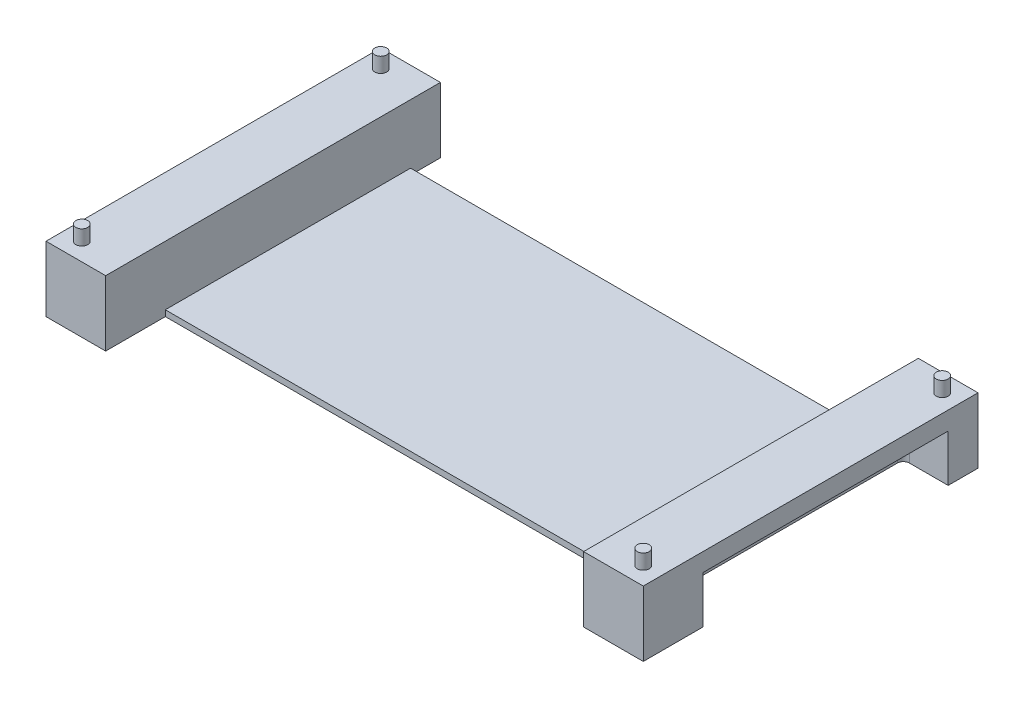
from build123d import *

# Parameters (mm, degrees)
SKETCH1_W             = 10
SKETCH1_H             = 56.1
BOSS_EXTRUDE1_DEPTH   = 3.05
BOSS_EXTRUDE1_2_DEPTH = 3.05
SKETCH1_4_R           = 1
SKETCH1_4_W           = 2.5
SKETCH1_4_H           = 41.1
BOSS_EXTRUDE2_DEPTH   = 7.9
BOSS_EXTRUDE3_START   = -7.9
SKETCH1_5_W           = 80.1
SKETCH1_5_H           = 41.1
BOSS_EXTRUDE3_DEPTH   = 1
BOSS_EXTRUDE4_START   = -7.9
SKETCH1_6_R           = 1
BOSS_EXTRUDE4_DEPTH   = 1
BOSS_EXTRUDE5_START   = 2.5
SKETCH2_R             = 1
BOSS_EXTRUDE5_DEPTH   = 2.5
FILLET1_R             = 1


with BuildPart() as part:
    # Sketch1 → Boss-Extrude1 (new body)
    with BuildSketch(Plane(origin=(0, 0, 0), x_dir=(1, 0, 0), z_dir=(0, 1, 0))):
        with Locations((-5, 18.05)):
            Rectangle(SKETCH1_W, SKETCH1_H)
    extrude(amount=BOSS_EXTRUDE1_DEPTH)



with BuildPart() as body_2:
    # Sketch1 → Boss-Extrude1 2 (new body)
    with BuildSketch(Plane(origin=(0, 0, 0), x_dir=(1, 0, 0), z_dir=(0, 1, 0))):
        with Locations((85.1, 18.05)):
            Rectangle(SKETCH1_W, SKETCH1_H)
    extrude(amount=BOSS_EXTRUDE1_2_DEPTH)


with BuildPart() as part_1:
    add(part.part)

    add(body_2.part)  # Boss-Extrude2 merges body 2
    # Sketch1_4 → Boss-Extrude2 (add)
    # profile 1 of 10: a face of its own
    with BuildSketch(Plane(origin=(0, 0, 0), x_dir=(1, 0, 0), z_dir=(0, 1, 0))):
        Polygon((0, -10), (0, 0), (-2.5, 0), (-10, 0), (-10, -10), align=None)
        with Locations((-7, -7)):
            Circle(SKETCH1_4_R, mode=Mode.SUBTRACT)
    # profile 2 of 10: a face of its own
    with BuildSketch(Plane(origin=(0, 0, 0), x_dir=(1, 0, 0), z_dir=(0, 1, 0))):
        with Locations((-1.25, 20.55)):
            Rectangle(SKETCH1_4_W, SKETCH1_4_H)
    # profile 3 of 10: a face of its own
    with BuildSketch(Plane(origin=(0, 0, 0), x_dir=(1, 0, 0), z_dir=(0, 1, 0))):
        Polygon((-2.5, 41.1), (0, 41.1), (0, 46.1), (-10, 46.1), (-10, 41.1), align=None)
        with Locations((-7, 43.1)):
            Circle(SKETCH1_4_R, mode=Mode.SUBTRACT)
    # profile 4 of 10: a face of its own
    with BuildSketch(Plane(origin=(0, 0, 0), x_dir=(1, 0, 0), z_dir=(0, 1, 0))):
        Polygon((82.6, 0), (80.1, 0), (80.1, -10), (90.1, -10), (90.1, 0), align=None)
        with Locations((87.1, -7)):
            Circle(SKETCH1_4_R, mode=Mode.SUBTRACT)
    # profile 5 of 10: a face of its own
    with BuildSketch(Plane(origin=(0, 0, 0), x_dir=(1, 0, 0), z_dir=(0, 1, 0))):
        with Locations((81.35, 20.55)):
            Rectangle(SKETCH1_4_W, SKETCH1_4_H)
    # profile 6 of 10: a face of its own
    with BuildSketch(Plane(origin=(0, 0, 0), x_dir=(1, 0, 0), z_dir=(0, 1, 0))):
        Polygon((80.1, 46.1), (80.1, 41.1), (82.6, 41.1), (90.1, 41.1), (90.1, 46.1), align=None)
        with Locations((87.1, 43.1)):
            Circle(SKETCH1_4_R, mode=Mode.SUBTRACT)
    # profile 7 of 10: a face of its own
    with BuildSketch(Plane(origin=(0, 0, 0), x_dir=(1, 0, 0), z_dir=(0, 1, 0))):
        with Locations((-7, -7)):
            Circle(SKETCH1_4_R)
    # profile 8 of 10: a face of its own
    with BuildSketch(Plane(origin=(0, 0, 0), x_dir=(1, 0, 0), z_dir=(0, 1, 0))):
        with Locations((-7, 43.1)):
            Circle(SKETCH1_4_R)
    # profile 9 of 10: a face of its own
    with BuildSketch(Plane(origin=(0, 0, 0), x_dir=(1, 0, 0), z_dir=(0, 1, 0))):
        with Locations((87.1, -7)):
            Circle(SKETCH1_4_R)
    # profile 10 of 10: a face of its own
    with BuildSketch(Plane(origin=(0, 0, 0), x_dir=(1, 0, 0), z_dir=(0, 1, 0))):
        with Locations((87.1, 43.1)):
            Circle(SKETCH1_4_R)
    extrude(amount=-BOSS_EXTRUDE2_DEPTH)

    # Sketch1_5 → Boss-Extrude3 (add)
    with BuildSketch(Plane(origin=(0, 0, 0), x_dir=(1, 0, 0), z_dir=(0, 1, 0)).offset(BOSS_EXTRUDE3_START)):
        with Locations((40.05, 20.55)):
            Rectangle(SKETCH1_5_W, SKETCH1_5_H)
    extrude(amount=BOSS_EXTRUDE3_DEPTH)

    # Sketch1_6 → Boss-Extrude4 (add)
    with BuildSketch(Plane(origin=(0, 0, 0), x_dir=(1, 0, 0), z_dir=(0, 1, 0)).offset(BOSS_EXTRUDE4_START)):
        with Locations(Location((-7, -7, 0), (0, 0, 270))):
            Circle(SKETCH1_6_R)
        with Locations(Location((-7, 43.1, 0), (0, 0, 270))):
            Circle(SKETCH1_6_R)
        with Locations(Location((87.1, 43.1, 0), (0, 0, 270))):
            Circle(SKETCH1_6_R)
        with Locations(Location((87.1, -7, 0), (0, 0, 270))):
            Circle(SKETCH1_6_R)
    extrude(amount=-BOSS_EXTRUDE4_DEPTH)

    # Sketch2 → Boss-Extrude5 (add)
    with BuildSketch(Plane(origin=(0, 3.05, 0), x_dir=(1, 0, 0), z_dir=(0, 1, 0)).offset(BOSS_EXTRUDE5_START)):
        with Locations(Location((87.1, -7, 0), (0, 0, 270))):
            Circle(SKETCH2_R)
        with Locations(Location((-7, 43.1, 0), (0, 0, 270))):
            Circle(SKETCH2_R)
        with Locations(Location((87.1, 43.1, 0), (0, 0, 270))):
            Circle(SKETCH2_R)
        with Locations(Location((-7, -7, 0), (0, 0, 270))):
            Circle(SKETCH2_R)
    extrude(amount=-BOSS_EXTRUDE5_DEPTH)

    # Fillet1
    fillet1_edges = [part_1.edges().sort_by_distance(p)[0] for p in [
        (82.6, -3.95, 0),
        (82.6, -3.95, -41.1),
        (-2.5, -3.95, 0),
        (-2.5, -3.95, -41.1),
    ]]
    fillet(fillet1_edges, radius=FILLET1_R)


solid = part_1.part
